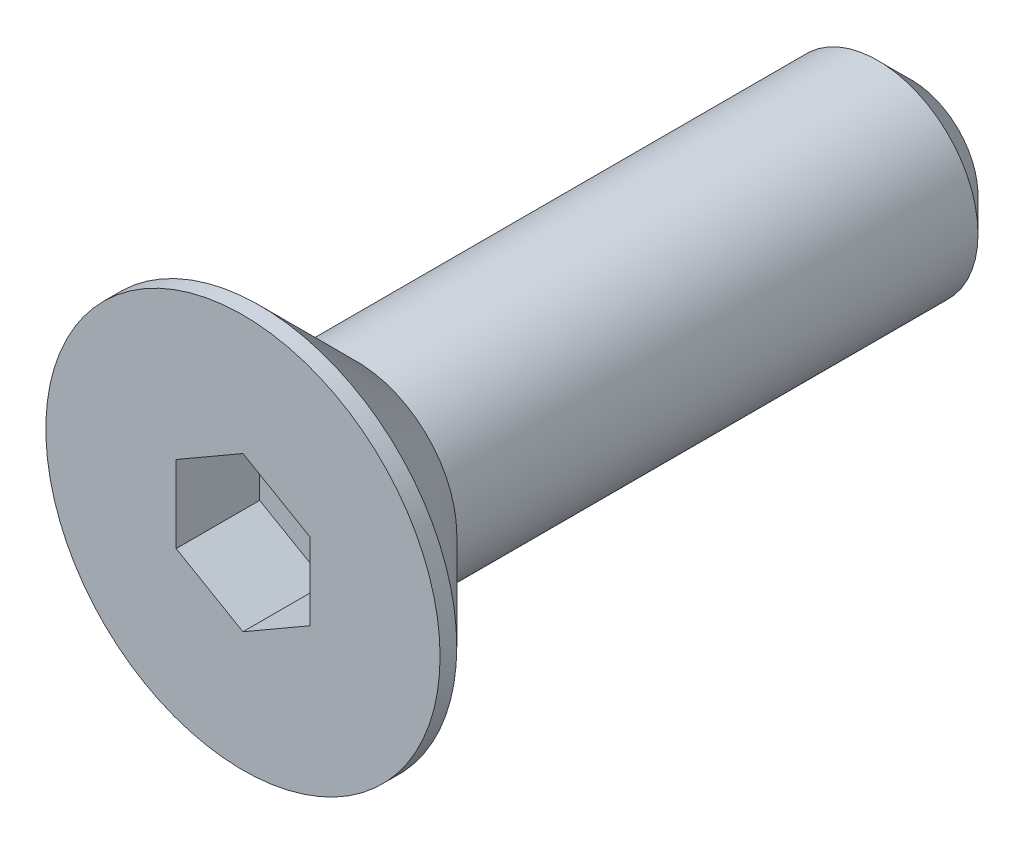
ISO-10303-21;
HEADER;
FILE_DESCRIPTION(('STEP AP214'),'2;1');
FILE_NAME('part.step','',(''),(''),'','','');
FILE_SCHEMA(('AUTOMOTIVE_DESIGN { 1 0 10303 214 1 1 1 1 }'));
ENDSEC;
DATA;
#1=APPLICATION_CONTEXT('core data for automotive mechanical design processes');
#2=APPLICATION_PROTOCOL_DEFINITION('international standard','automotive_design',2000,#1);
#3=PRODUCT_CONTEXT('',#1,'mechanical');
#4=PRODUCT('Part','Part','',(#3));
#5=PRODUCT_RELATED_PRODUCT_CATEGORY('part','',(#4));
#6=PRODUCT_DEFINITION_FORMATION('','',#4);
#7=PRODUCT_DEFINITION_CONTEXT('part definition',#1,'design');
#8=PRODUCT_DEFINITION('design','',#6,#7);
#9=PRODUCT_DEFINITION_SHAPE('','',#8);
#10=(LENGTH_UNIT() NAMED_UNIT(*) SI_UNIT(.MILLI.,.METRE.));
#11=(NAMED_UNIT(*) PLANE_ANGLE_UNIT() SI_UNIT($,.RADIAN.));
#12=(NAMED_UNIT(*) SI_UNIT($,.STERADIAN.) SOLID_ANGLE_UNIT());
#13=UNCERTAINTY_MEASURE_WITH_UNIT(LENGTH_MEASURE(1.E-05),#10,'distance_accuracy_value','');
#14=(GEOMETRIC_REPRESENTATION_CONTEXT(3) GLOBAL_UNCERTAINTY_ASSIGNED_CONTEXT((#13)) GLOBAL_UNIT_ASSIGNED_CONTEXT((#10,
#11,#12)) REPRESENTATION_CONTEXT('',''));
#15=CARTESIAN_POINT('',(0.,0.,0.));
#16=DIRECTION('',(0.,0.,1.));
#17=DIRECTION('',(1.,0.,0.));
#18=AXIS2_PLACEMENT_3D('',#15,#16,#17);
#19=CARTESIAN_POINT('',(0.,0.,0.));
#20=DIRECTION('',(0.,0.,1.));
#21=DIRECTION('',(1.,0.,0.));
#22=AXIS2_PLACEMENT_3D('',#19,#20,#21);
#23=PLANE('',#22);
#24=DIRECTION('',(0.866025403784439,-0.5,0.));
#25=VECTOR('',#24,1.);
#26=CARTESIAN_POINT('',(-2.,-1.15470053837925,0.));
#27=LINE('',#26,#25);
#28=CARTESIAN_POINT('',(-2.,-1.15470053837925,0.));
#29=VERTEX_POINT('',#28);
#30=CARTESIAN_POINT('',(0.,-2.30940107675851,0.));
#31=VERTEX_POINT('',#30);
#32=EDGE_CURVE('E29',#29,#31,#27,.T.);
#33=ORIENTED_EDGE('',*,*,#32,.F.);
#34=DIRECTION('',(0.,-1.,0.));
#35=VECTOR('',#34,1.);
#36=CARTESIAN_POINT('',(-2.,1.15470053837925,0.));
#37=LINE('',#36,#35);
#38=CARTESIAN_POINT('',(-2.,1.15470053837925,0.));
#39=VERTEX_POINT('',#38);
#40=EDGE_CURVE('E98',#39,#29,#37,.T.);
#41=ORIENTED_EDGE('',*,*,#40,.F.);
#42=DIRECTION('',(-0.866025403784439,-0.5,0.));
#43=VECTOR('',#42,1.);
#44=CARTESIAN_POINT('',(0.,2.30940107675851,0.));
#45=LINE('',#44,#43);
#46=CARTESIAN_POINT('',(0.,2.30940107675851,0.));
#47=VERTEX_POINT('',#46);
#48=EDGE_CURVE('E92',#47,#39,#45,.T.);
#49=ORIENTED_EDGE('',*,*,#48,.F.);
#50=DIRECTION('',(-0.866025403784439,0.5,0.));
#51=VECTOR('',#50,1.);
#52=CARTESIAN_POINT('',(2.,1.15470053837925,0.));
#53=LINE('',#52,#51);
#54=CARTESIAN_POINT('',(2.,1.15470053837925,0.));
#55=VERTEX_POINT('',#54);
#56=EDGE_CURVE('E90',#55,#47,#53,.T.);
#57=ORIENTED_EDGE('',*,*,#56,.F.);
#58=DIRECTION('',(0.,1.,0.));
#59=VECTOR('',#58,1.);
#60=CARTESIAN_POINT('',(2.,-1.15470053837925,0.));
#61=LINE('',#60,#59);
#62=CARTESIAN_POINT('',(2.,-1.15470053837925,0.));
#63=VERTEX_POINT('',#62);
#64=EDGE_CURVE('E72',#63,#55,#61,.T.);
#65=ORIENTED_EDGE('',*,*,#64,.F.);
#66=DIRECTION('',(0.866025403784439,0.5,0.));
#67=VECTOR('',#66,1.);
#68=CARTESIAN_POINT('',(0.,-2.30940107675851,0.));
#69=LINE('',#68,#67);
#70=EDGE_CURVE('E83',#31,#63,#69,.T.);
#71=ORIENTED_EDGE('',*,*,#70,.F.);
#72=EDGE_LOOP('',(#33,#41,#49,#57,#65,#71));
#73=FACE_BOUND('',#72,.T.);
#74=CARTESIAN_POINT('',(0.,0.,0.));
#75=DIRECTION('',(0.,0.,1.));
#76=DIRECTION('',(1.,0.,0.));
#77=AXIS2_PLACEMENT_3D('',#74,#75,#76);
#78=CIRCLE('',#77,5.9);
#79=CARTESIAN_POINT('',(5.9,0.,0.));
#80=VERTEX_POINT('',#79);
#81=EDGE_CURVE('E128',#80,#80,#78,.T.);
#82=ORIENTED_EDGE('',*,*,#81,.T.);
#83=EDGE_LOOP('',(#82));
#84=FACE_BOUND('',#83,.T.);
#85=ADVANCED_FACE('F14',(#73,#84),#23,.T.);
#86=CARTESIAN_POINT('',(0.,0.,6.05968084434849));
#87=DIRECTION('',(0.,0.,1.));
#88=DIRECTION('',(1.,0.,0.));
#89=AXIS2_PLACEMENT_3D('',#86,#87,#88);
#90=CYLINDRICAL_SURFACE('',#89,5.9);
#91=CARTESIAN_POINT('',(0.,0.,-0.5));
#92=DIRECTION('',(0.,0.,1.));
#93=DIRECTION('',(1.,0.,0.));
#94=AXIS2_PLACEMENT_3D('',#91,#92,#93);
#95=CIRCLE('',#94,5.9);
#96=CARTESIAN_POINT('',(5.9,0.,-0.5));
#97=VERTEX_POINT('',#96);
#98=EDGE_CURVE('E125',#97,#97,#95,.T.);
#99=ORIENTED_EDGE('',*,*,#98,.T.);
#100=EDGE_LOOP('',(#99));
#101=FACE_BOUND('',#100,.T.);
#102=ORIENTED_EDGE('',*,*,#81,.F.);
#103=EDGE_LOOP('',(#102));
#104=FACE_BOUND('',#103,.T.);
#105=ADVANCED_FACE('F148',(#101,#104),#90,.T.);
#106=CARTESIAN_POINT('',(0.,0.,-0.5));
#107=DIRECTION('',(0.,0.,1.));
#108=DIRECTION('',(1.,0.,0.));
#109=AXIS2_PLACEMENT_3D('',#106,#107,#108);
#110=CONICAL_SURFACE('',#109,5.9,0.78539816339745);
#111=CARTESIAN_POINT('',(0.,0.,-3.4));
#112=DIRECTION('',(0.,0.,1.));
#113=DIRECTION('',(1.,0.,0.));
#114=AXIS2_PLACEMENT_3D('',#111,#112,#113);
#115=CIRCLE('',#114,3.);
#116=CARTESIAN_POINT('',(3.,0.,-3.4));
#117=VERTEX_POINT('',#116);
#118=EDGE_CURVE('E116',#117,#117,#115,.T.);
#119=ORIENTED_EDGE('',*,*,#118,.T.);
#120=EDGE_LOOP('',(#119));
#121=FACE_BOUND('',#120,.T.);
#122=ORIENTED_EDGE('',*,*,#98,.F.);
#123=EDGE_LOOP('',(#122));
#124=FACE_BOUND('',#123,.T.);
#125=ADVANCED_FACE('F153',(#121,#124),#110,.T.);
#126=CARTESIAN_POINT('',(0.,0.,6.05968084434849));
#127=DIRECTION('',(0.,0.,1.));
#128=DIRECTION('',(1.,0.,0.));
#129=AXIS2_PLACEMENT_3D('',#126,#127,#128);
#130=CYLINDRICAL_SURFACE('',#129,3.);
#131=CARTESIAN_POINT('',(0.,0.,-19.));
#132=DIRECTION('',(0.,0.,-1.));
#133=DIRECTION('',(-1.,0.,0.));
#134=AXIS2_PLACEMENT_3D('',#131,#132,#133);
#135=CIRCLE('',#134,3.);
#136=CARTESIAN_POINT('',(-3.,0.,-19.));
#137=VERTEX_POINT('',#136);
#138=EDGE_CURVE('E22',#137,#137,#135,.F.);
#139=ORIENTED_EDGE('',*,*,#138,.T.);
#140=EDGE_LOOP('',(#139));
#141=FACE_BOUND('',#140,.T.);
#142=ORIENTED_EDGE('',*,*,#118,.F.);
#143=EDGE_LOOP('',(#142));
#144=FACE_BOUND('',#143,.T.);
#145=ADVANCED_FACE('F133',(#141,#144),#130,.T.);
#146=CARTESIAN_POINT('',(3.,0.,-20.));
#147=DIRECTION('',(0.,0.,-1.));
#148=DIRECTION('',(-1.,0.,0.));
#149=AXIS2_PLACEMENT_3D('',#146,#147,#148);
#150=PLANE('',#149);
#151=CARTESIAN_POINT('',(0.,0.,-20.));
#152=DIRECTION('',(0.,0.,-1.));
#153=DIRECTION('',(-1.,0.,0.));
#154=AXIS2_PLACEMENT_3D('',#151,#152,#153);
#155=CIRCLE('',#154,2.);
#156=CARTESIAN_POINT('',(-2.,0.,-20.));
#157=VERTEX_POINT('',#156);
#158=EDGE_CURVE('E9',#157,#157,#155,.T.);
#159=ORIENTED_EDGE('',*,*,#158,.T.);
#160=EDGE_LOOP('',(#159));
#161=FACE_BOUND('',#160,.T.);
#162=ADVANCED_FACE('F162',(#161),#150,.T.);
#163=CARTESIAN_POINT('',(-2.,-1.15470053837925,-2.5));
#164=DIRECTION('',(-0.5,-0.866025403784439,0.));
#165=DIRECTION('',(0.866025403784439,-0.5,0.));
#166=AXIS2_PLACEMENT_3D('',#163,#164,#165);
#167=PLANE('',#166);
#168=ORIENTED_EDGE('',*,*,#32,.T.);
#169=DIRECTION('',(0.,0.,1.));
#170=VECTOR('',#169,1.);
#171=CARTESIAN_POINT('',(0.,-2.30940107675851,-2.5));
#172=LINE('',#171,#170);
#173=CARTESIAN_POINT('',(0.,-2.30940107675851,-2.5));
#174=VERTEX_POINT('',#173);
#175=EDGE_CURVE('E80',#174,#31,#172,.T.);
#176=ORIENTED_EDGE('',*,*,#175,.F.);
#177=DIRECTION('',(0.866025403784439,-0.5,0.));
#178=VECTOR('',#177,1.);
#179=CARTESIAN_POINT('',(-2.,-1.15470053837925,-2.5));
#180=LINE('',#179,#178);
#181=CARTESIAN_POINT('',(-2.,-1.15470053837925,-2.5));
#182=VERTEX_POINT('',#181);
#183=EDGE_CURVE('E100',#182,#174,#180,.T.);
#184=ORIENTED_EDGE('',*,*,#183,.F.);
#185=DIRECTION('',(0.,0.,1.));
#186=VECTOR('',#185,1.);
#187=CARTESIAN_POINT('',(-2.,-1.15470053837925,-2.5));
#188=LINE('',#187,#186);
#189=EDGE_CURVE('E36',#182,#29,#188,.T.);
#190=ORIENTED_EDGE('',*,*,#189,.T.);
#191=EDGE_LOOP('',(#168,#176,#184,#190));
#192=FACE_BOUND('',#191,.T.);
#193=ADVANCED_FACE('F165',(#192),#167,.F.);
#194=CARTESIAN_POINT('',(-2.,1.15470053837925,-2.5));
#195=DIRECTION('',(-1.,0.,0.));
#196=DIRECTION('',(0.,0.,1.));
#197=AXIS2_PLACEMENT_3D('',#194,#195,#196);
#198=PLANE('',#197);
#199=ORIENTED_EDGE('',*,*,#40,.T.);
#200=ORIENTED_EDGE('',*,*,#189,.F.);
#201=DIRECTION('',(0.,-1.,0.));
#202=VECTOR('',#201,1.);
#203=CARTESIAN_POINT('',(-2.,1.15470053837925,-2.5));
#204=LINE('',#203,#202);
#205=CARTESIAN_POINT('',(-2.,1.15470053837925,-2.5));
#206=VERTEX_POINT('',#205);
#207=EDGE_CURVE('E112',#206,#182,#204,.T.);
#208=ORIENTED_EDGE('',*,*,#207,.F.);
#209=DIRECTION('',(0.,0.,1.));
#210=VECTOR('',#209,1.);
#211=CARTESIAN_POINT('',(-2.,1.15470053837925,-2.5));
#212=LINE('',#211,#210);
#213=EDGE_CURVE('E117',#206,#39,#212,.T.);
#214=ORIENTED_EDGE('',*,*,#213,.T.);
#215=EDGE_LOOP('',(#199,#200,#208,#214));
#216=FACE_BOUND('',#215,.T.);
#217=ADVANCED_FACE('F169',(#216),#198,.F.);
#218=CARTESIAN_POINT('',(0.,2.30940107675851,-2.5));
#219=DIRECTION('',(-0.5,0.866025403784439,0.));
#220=DIRECTION('',(-0.866025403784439,-0.5,0.));
#221=AXIS2_PLACEMENT_3D('',#218,#219,#220);
#222=PLANE('',#221);
#223=ORIENTED_EDGE('',*,*,#48,.T.);
#224=ORIENTED_EDGE('',*,*,#213,.F.);
#225=DIRECTION('',(-0.866025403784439,-0.5,0.));
#226=VECTOR('',#225,1.);
#227=CARTESIAN_POINT('',(0.,2.30940107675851,-2.5));
#228=LINE('',#227,#226);
#229=CARTESIAN_POINT('',(0.,2.30940107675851,-2.5));
#230=VERTEX_POINT('',#229);
#231=EDGE_CURVE('E109',#230,#206,#228,.T.);
#232=ORIENTED_EDGE('',*,*,#231,.F.);
#233=DIRECTION('',(0.,0.,1.));
#234=VECTOR('',#233,1.);
#235=CARTESIAN_POINT('',(0.,2.30940107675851,-2.5));
#236=LINE('',#235,#234);
#237=EDGE_CURVE('E119',#230,#47,#236,.T.);
#238=ORIENTED_EDGE('',*,*,#237,.T.);
#239=EDGE_LOOP('',(#223,#224,#232,#238));
#240=FACE_BOUND('',#239,.T.);
#241=ADVANCED_FACE('F177',(#240),#222,.F.);
#242=CARTESIAN_POINT('',(2.,1.15470053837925,-2.5));
#243=DIRECTION('',(0.5,0.866025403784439,0.));
#244=DIRECTION('',(-0.866025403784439,0.5,0.));
#245=AXIS2_PLACEMENT_3D('',#242,#243,#244);
#246=PLANE('',#245);
#247=ORIENTED_EDGE('',*,*,#56,.T.);
#248=ORIENTED_EDGE('',*,*,#237,.F.);
#249=DIRECTION('',(-0.866025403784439,0.5,0.));
#250=VECTOR('',#249,1.);
#251=CARTESIAN_POINT('',(2.,1.15470053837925,-2.5));
#252=LINE('',#251,#250);
#253=CARTESIAN_POINT('',(2.,1.15470053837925,-2.5));
#254=VERTEX_POINT('',#253);
#255=EDGE_CURVE('E106',#254,#230,#252,.T.);
#256=ORIENTED_EDGE('',*,*,#255,.F.);
#257=DIRECTION('',(0.,0.,1.));
#258=VECTOR('',#257,1.);
#259=CARTESIAN_POINT('',(2.,1.15470053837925,-2.5));
#260=LINE('',#259,#258);
#261=EDGE_CURVE('E79',#254,#55,#260,.T.);
#262=ORIENTED_EDGE('',*,*,#261,.T.);
#263=EDGE_LOOP('',(#247,#248,#256,#262));
#264=FACE_BOUND('',#263,.T.);
#265=ADVANCED_FACE('F174',(#264),#246,.F.);
#266=CARTESIAN_POINT('',(2.,-1.15470053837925,-2.5));
#267=DIRECTION('',(1.,0.,0.));
#268=DIRECTION('',(0.,1.,0.));
#269=AXIS2_PLACEMENT_3D('',#266,#267,#268);
#270=PLANE('',#269);
#271=ORIENTED_EDGE('',*,*,#64,.T.);
#272=ORIENTED_EDGE('',*,*,#261,.F.);
#273=DIRECTION('',(0.,1.,0.));
#274=VECTOR('',#273,1.);
#275=CARTESIAN_POINT('',(2.,-1.15470053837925,-2.5));
#276=LINE('',#275,#274);
#277=CARTESIAN_POINT('',(2.,-1.15470053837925,-2.5));
#278=VERTEX_POINT('',#277);
#279=EDGE_CURVE('E75',#278,#254,#276,.T.);
#280=ORIENTED_EDGE('',*,*,#279,.F.);
#281=DIRECTION('',(0.,0.,1.));
#282=VECTOR('',#281,1.);
#283=CARTESIAN_POINT('',(2.,-1.15470053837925,-2.5));
#284=LINE('',#283,#282);
#285=EDGE_CURVE('E68',#278,#63,#284,.T.);
#286=ORIENTED_EDGE('',*,*,#285,.T.);
#287=EDGE_LOOP('',(#271,#272,#280,#286));
#288=FACE_BOUND('',#287,.T.);
#289=ADVANCED_FACE('F70',(#288),#270,.F.);
#290=CARTESIAN_POINT('',(0.,-2.30940107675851,-2.5));
#291=DIRECTION('',(0.5,-0.866025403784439,0.));
#292=DIRECTION('',(0.866025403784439,0.5,0.));
#293=AXIS2_PLACEMENT_3D('',#290,#291,#292);
#294=PLANE('',#293);
#295=ORIENTED_EDGE('',*,*,#70,.T.);
#296=ORIENTED_EDGE('',*,*,#285,.F.);
#297=DIRECTION('',(0.866025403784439,0.5,0.));
#298=VECTOR('',#297,1.);
#299=CARTESIAN_POINT('',(0.,-2.30940107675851,-2.5));
#300=LINE('',#299,#298);
#301=EDGE_CURVE('E103',#174,#278,#300,.T.);
#302=ORIENTED_EDGE('',*,*,#301,.F.);
#303=ORIENTED_EDGE('',*,*,#175,.T.);
#304=EDGE_LOOP('',(#295,#296,#302,#303));
#305=FACE_BOUND('',#304,.T.);
#306=ADVANCED_FACE('F84',(#305),#294,.F.);
#307=CARTESIAN_POINT('',(-4.,0.,-2.5));
#308=DIRECTION('',(0.,0.,-1.));
#309=DIRECTION('',(-1.,0.,0.));
#310=AXIS2_PLACEMENT_3D('',#307,#308,#309);
#311=PLANE('',#310);
#312=ORIENTED_EDGE('',*,*,#183,.T.);
#313=ORIENTED_EDGE('',*,*,#301,.T.);
#314=ORIENTED_EDGE('',*,*,#279,.T.);
#315=ORIENTED_EDGE('',*,*,#255,.T.);
#316=ORIENTED_EDGE('',*,*,#231,.T.);
#317=ORIENTED_EDGE('',*,*,#207,.T.);
#318=EDGE_LOOP('',(#312,#313,#314,#315,#316,#317));
#319=FACE_BOUND('',#318,.T.);
#320=ADVANCED_FACE('F137',(#319),#311,.F.);
#321=CARTESIAN_POINT('',(0.,0.,-19.));
#322=DIRECTION('',(0.,0.,1.));
#323=DIRECTION('',(1.,0.,0.));
#324=AXIS2_PLACEMENT_3D('',#321,#322,#323);
#325=CONICAL_SURFACE('',#324,3.,0.785398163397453);
#326=ORIENTED_EDGE('',*,*,#158,.F.);
#327=EDGE_LOOP('',(#326));
#328=FACE_BOUND('',#327,.T.);
#329=ORIENTED_EDGE('',*,*,#138,.F.);
#330=EDGE_LOOP('',(#329));
#331=FACE_BOUND('',#330,.T.);
#332=ADVANCED_FACE('F16',(#328,#331),#325,.T.);
#333=CLOSED_SHELL('',(#85,#105,#125,#145,#162,#193,#217,#241,#265,#289,#306,#320,#332));
#334=MANIFOLD_SOLID_BREP('B1',#333);
#335=ADVANCED_BREP_SHAPE_REPRESENTATION('',(#18,#334),#14);
#336=SHAPE_DEFINITION_REPRESENTATION(#9,#335);
ENDSEC;
END-ISO-10303-21;
